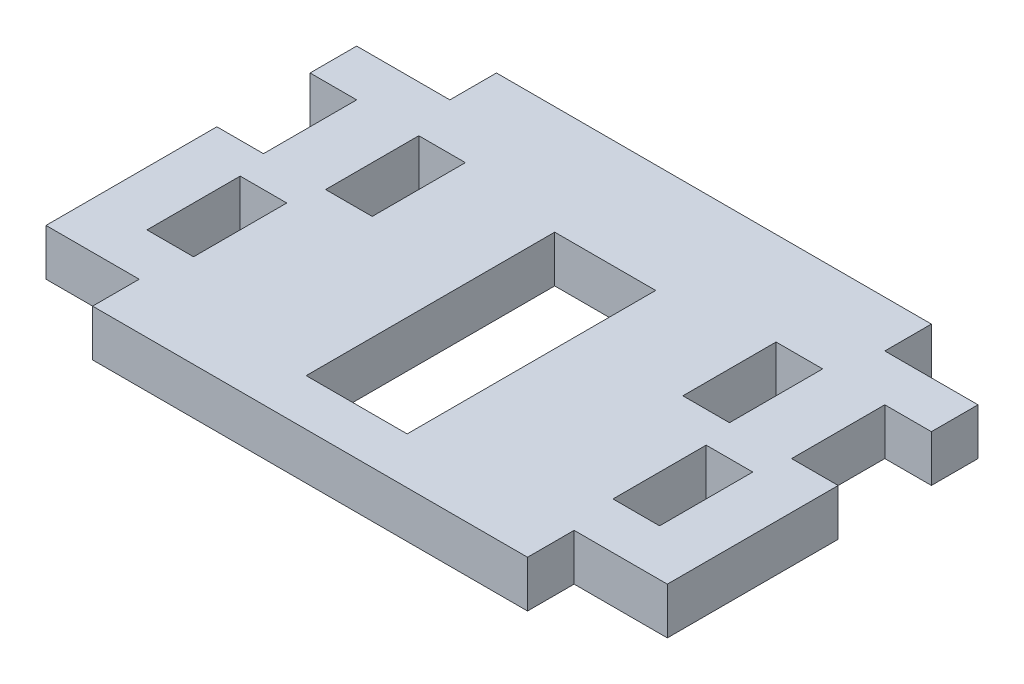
from build123d import *

# Parameters (mm, degrees)
SKETCH1_W           = 40
SKETCH1_H           = 20
BOSS_EXTRUDE1_DEPTH = 3
SKETCH2_W           = 28
SKETCH2_H           = 3
BOSS_EXTRUDE2_DEPTH = 3
CUT_EXTRUDE1_DEPTH  = 3
SKETCH4_W           = 3
SKETCH4_H           = 6
CUT_EXTRUDE2_DEPTH  = 3


with BuildPart() as part:
    # Sketch1 → Boss-Extrude1 (new body)
    with BuildSketch(Plane(origin=(0, 0, 0), x_dir=(1, 0, 0), z_dir=(0, 1, 0))):
        Rectangle(SKETCH1_W, SKETCH1_H)
    extrude(amount=BOSS_EXTRUDE1_DEPTH)

    # Sketch2 → Boss-Extrude2 (add)
    with BuildSketch(Plane(origin=(0, 0, 0), x_dir=(1, 0, 0), z_dir=(0, 1, 0))):
        with Locations((0, 11.5)):
            Rectangle(SKETCH2_W, SKETCH2_H)
        with Locations((0, -11.5)):
            Rectangle(SKETCH2_W, SKETCH2_H)
    extrude(amount=BOSS_EXTRUDE2_DEPTH)

    # Sketch3 → Cut-Extrude1 (cut)
    with BuildSketch(Plane(origin=(0, 0, 0), x_dir=(1, 0, 0), z_dir=(0, 1, 0))):
        Polygon((-3.25, 6), (3.25, 6), (3.25, -6), (3.25, -10), (-3.25, -10), (-3.25, -6), align=None)
    extrude(amount=CUT_EXTRUDE1_DEPTH, mode=Mode.SUBTRACT)

    # Sketch4 → Cut-Extrude2 (cut)
    with BuildSketch(Plane(origin=(0, 0, 0), x_dir=(1, 0, 0), z_dir=(0, 1, 0))):
        with Locations((-18.5, 4)):
            Rectangle(SKETCH4_W, SKETCH4_H)
        with Locations((-11.5, 4)):
            Rectangle(SKETCH4_W, SKETCH4_H)
        with Locations((-15, -4)):
            Rectangle(SKETCH4_W, SKETCH4_H)
        with Locations((15, -4)):
            Rectangle(SKETCH4_W, SKETCH4_H)
        with Locations((11.5, 4)):
            Rectangle(SKETCH4_W, SKETCH4_H)
        with Locations((18.5, 4)):
            Rectangle(SKETCH4_W, SKETCH4_H)
    extrude(amount=CUT_EXTRUDE2_DEPTH, mode=Mode.SUBTRACT)


solid = part.part
